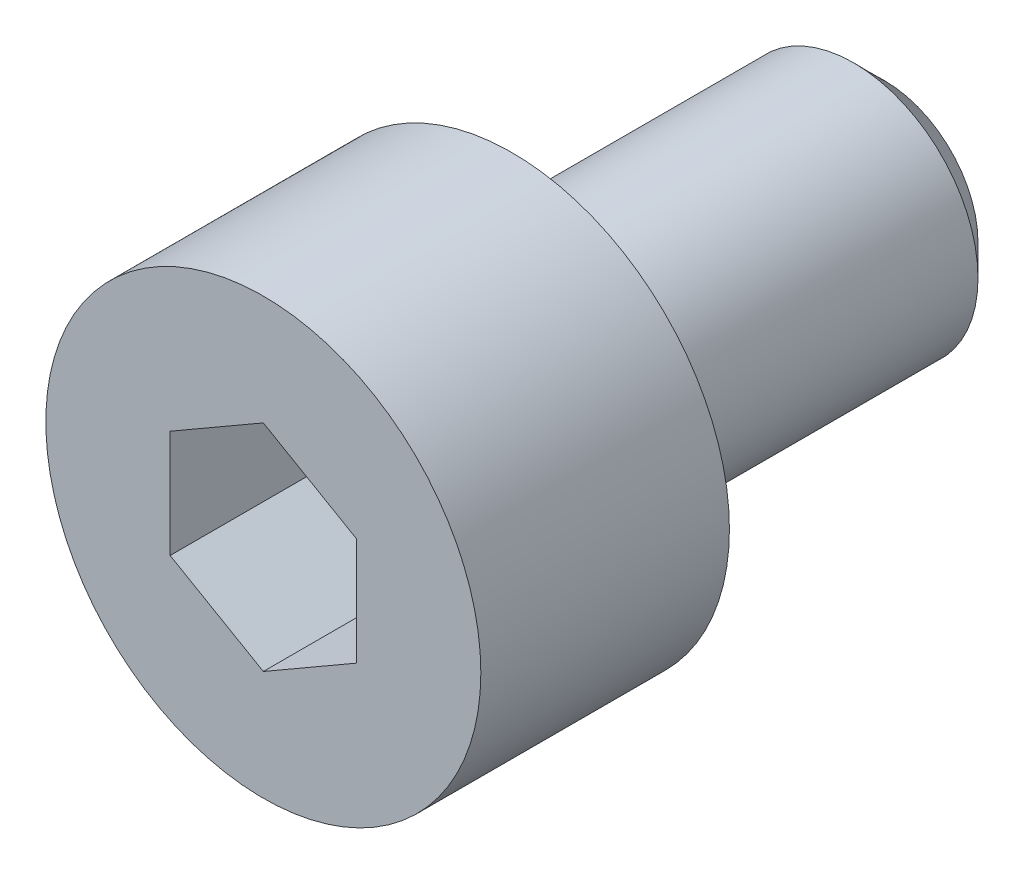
from build123d import *

# Parameters (mm, degrees)
SKETCH1_R           = 3.5
BASE_EXTRUDE_DEPTH  = 4
SKETCH2_R           = 2
BOSS_EXTRUDE1_DEPTH = 6
CUT_EXTRUDE1_DEPTH  = 3.999999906
CHAMFER1_SIZE       = 0.5


with BuildPart() as part:
    # Sketch1 → Base-Extrude (new body)
    with BuildSketch(Plane.XY):
        Circle(SKETCH1_R)
    extrude(amount=-BASE_EXTRUDE_DEPTH)

    # Sketch2 → Boss-Extrude1 (add)
    with BuildSketch(Plane(origin=(0, 0, -4), x_dir=(-1, 0, 0), z_dir=(0, 0, -1))):
        with Locations(Location((0, 0, 0), (0, 0, 180))):
            Circle(SKETCH2_R)
    extrude(amount=BOSS_EXTRUDE1_DEPTH)

    # Sketch3 → Cut-Extrude1 (cut)
    with BuildSketch(Plane.XY):
        Polygon((1.5, -0.866025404), (1.5, 0.866025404), (0, 1.732050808), (-1.5, 0.866025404), (-1.5, -0.866025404), (0, -1.732050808), align=None)
    extrude(amount=-CUT_EXTRUDE1_DEPTH, mode=Mode.SUBTRACT)

    # Chamfer1
    chamfer1_edges = [part.edges().sort_by_distance(p)[0] for p in [
        (-2, 0, -10),
    ]]
    chamfer(chamfer1_edges, length=CHAMFER1_SIZE)


solid = part.part
